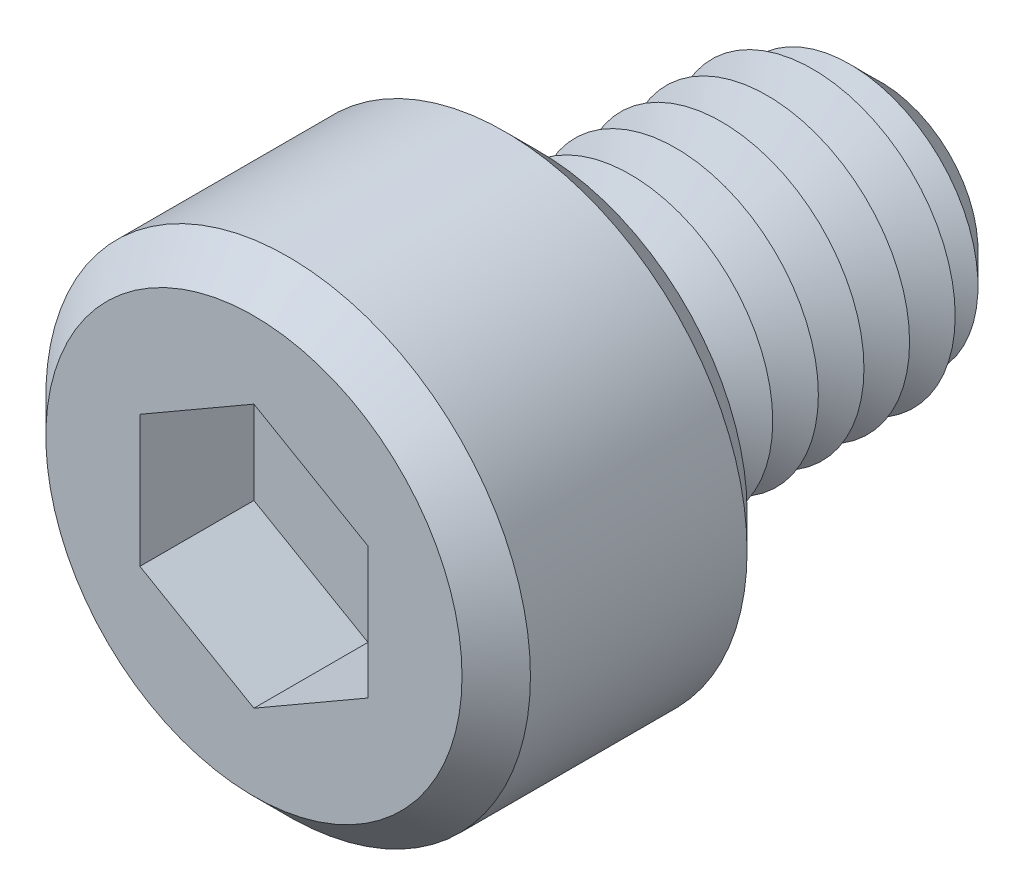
ISO-10303-21;
HEADER;
FILE_DESCRIPTION(('STEP AP214'),'2;1');
FILE_NAME('part.step','',(''),(''),'','','');
FILE_SCHEMA(('AUTOMOTIVE_DESIGN { 1 0 10303 214 1 1 1 1 }'));
ENDSEC;
DATA;
#1=APPLICATION_CONTEXT('core data for automotive mechanical design processes');
#2=APPLICATION_PROTOCOL_DEFINITION('international standard','automotive_design',2000,#1);
#3=PRODUCT_CONTEXT('',#1,'mechanical');
#4=PRODUCT('Part','Part','',(#3));
#5=PRODUCT_RELATED_PRODUCT_CATEGORY('part','',(#4));
#6=PRODUCT_DEFINITION_FORMATION('','',#4);
#7=PRODUCT_DEFINITION_CONTEXT('part definition',#1,'design');
#8=PRODUCT_DEFINITION('design','',#6,#7);
#9=PRODUCT_DEFINITION_SHAPE('','',#8);
#10=(LENGTH_UNIT() NAMED_UNIT(*) SI_UNIT(.MILLI.,.METRE.));
#11=(NAMED_UNIT(*) PLANE_ANGLE_UNIT() SI_UNIT($,.RADIAN.));
#12=(NAMED_UNIT(*) SI_UNIT($,.STERADIAN.) SOLID_ANGLE_UNIT());
#13=UNCERTAINTY_MEASURE_WITH_UNIT(LENGTH_MEASURE(1.E-05),#10,'distance_accuracy_value','');
#14=(GEOMETRIC_REPRESENTATION_CONTEXT(3) GLOBAL_UNCERTAINTY_ASSIGNED_CONTEXT((#13)) GLOBAL_UNIT_ASSIGNED_CONTEXT((#10,
#11,#12)) REPRESENTATION_CONTEXT('',''));
#15=CARTESIAN_POINT('',(0.,0.,0.));
#16=DIRECTION('',(0.,0.,1.));
#17=DIRECTION('',(1.,0.,0.));
#18=AXIS2_PLACEMENT_3D('',#15,#16,#17);
#19=CARTESIAN_POINT('',(0.,0.,5.));
#20=DIRECTION('',(0.,0.,-1.));
#21=DIRECTION('',(-1.,0.,0.));
#22=AXIS2_PLACEMENT_3D('',#19,#20,#21);
#23=CYLINDRICAL_SURFACE('',#22,4.25);
#24=CARTESIAN_POINT('',(0.,0.,0.600000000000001));
#25=DIRECTION('',(0.,0.,1.));
#26=DIRECTION('',(1.,0.,0.));
#27=AXIS2_PLACEMENT_3D('',#24,#25,#26);
#28=CIRCLE('',#27,4.25);
#29=CARTESIAN_POINT('',(4.25,0.,0.600000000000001));
#30=VERTEX_POINT('',#29);
#31=EDGE_CURVE('E232',#30,#30,#28,.T.);
#32=ORIENTED_EDGE('',*,*,#31,.T.);
#33=EDGE_LOOP('',(#32));
#34=FACE_BOUND('',#33,.T.);
#35=CARTESIAN_POINT('',(0.,0.,4.4));
#36=DIRECTION('',(0.,0.,1.));
#37=DIRECTION('',(1.,0.,0.));
#38=AXIS2_PLACEMENT_3D('',#35,#36,#37);
#39=CIRCLE('',#38,4.25);
#40=CARTESIAN_POINT('',(4.25,0.,4.4));
#41=VERTEX_POINT('',#40);
#42=EDGE_CURVE('E225',#41,#41,#39,.F.);
#43=ORIENTED_EDGE('',*,*,#42,.T.);
#44=EDGE_LOOP('',(#43));
#45=FACE_BOUND('',#44,.T.);
#46=ADVANCED_FACE('F39',(#34,#45),#23,.T.);
#47=CARTESIAN_POINT('',(0.,0.,5.));
#48=DIRECTION('',(0.,0.,1.));
#49=DIRECTION('',(1.,0.,0.));
#50=AXIS2_PLACEMENT_3D('',#47,#48,#49);
#51=PLANE('',#50);
#52=CARTESIAN_POINT('',(0.,0.,5.));
#53=DIRECTION('',(0.,0.,1.));
#54=DIRECTION('',(1.,0.,0.));
#55=AXIS2_PLACEMENT_3D('',#52,#53,#54);
#56=CIRCLE('',#55,3.65);
#57=CARTESIAN_POINT('',(3.65,0.,5.));
#58=VERTEX_POINT('',#57);
#59=EDGE_CURVE('E11',#58,#58,#56,.T.);
#60=ORIENTED_EDGE('',*,*,#59,.T.);
#61=EDGE_LOOP('',(#60));
#62=FACE_BOUND('',#61,.T.);
#63=DIRECTION('',(-0.866025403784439,0.5,0.));
#64=VECTOR('',#63,1.);
#65=CARTESIAN_POINT('',(2.,1.15470053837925,5.));
#66=LINE('',#65,#64);
#67=CARTESIAN_POINT('',(2.,1.15470053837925,5.));
#68=VERTEX_POINT('',#67);
#69=CARTESIAN_POINT('',(0.,2.3094010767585,5.));
#70=VERTEX_POINT('',#69);
#71=EDGE_CURVE('E55',#68,#70,#66,.T.);
#72=ORIENTED_EDGE('',*,*,#71,.F.);
#73=DIRECTION('',(0.,1.,0.));
#74=VECTOR('',#73,1.);
#75=CARTESIAN_POINT('',(2.,-1.15470053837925,5.));
#76=LINE('',#75,#74);
#77=CARTESIAN_POINT('',(2.,-1.15470053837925,5.));
#78=VERTEX_POINT('',#77);
#79=EDGE_CURVE('E150',#78,#68,#76,.T.);
#80=ORIENTED_EDGE('',*,*,#79,.F.);
#81=DIRECTION('',(0.866025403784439,0.5,0.));
#82=VECTOR('',#81,1.);
#83=CARTESIAN_POINT('',(0.,-2.3094010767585,5.));
#84=LINE('',#83,#82);
#85=CARTESIAN_POINT('',(0.,-2.3094010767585,5.));
#86=VERTEX_POINT('',#85);
#87=EDGE_CURVE('E147',#86,#78,#84,.T.);
#88=ORIENTED_EDGE('',*,*,#87,.F.);
#89=DIRECTION('',(0.866025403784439,-0.5,0.));
#90=VECTOR('',#89,1.);
#91=CARTESIAN_POINT('',(-2.,-1.15470053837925,5.));
#92=LINE('',#91,#90);
#93=CARTESIAN_POINT('',(-2.,-1.15470053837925,5.));
#94=VERTEX_POINT('',#93);
#95=EDGE_CURVE('E103',#94,#86,#92,.T.);
#96=ORIENTED_EDGE('',*,*,#95,.F.);
#97=DIRECTION('',(0.,-1.,0.));
#98=VECTOR('',#97,1.);
#99=CARTESIAN_POINT('',(-2.,1.15470053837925,5.));
#100=LINE('',#99,#98);
#101=CARTESIAN_POINT('',(-2.,1.15470053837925,5.));
#102=VERTEX_POINT('',#101);
#103=EDGE_CURVE('E141',#102,#94,#100,.T.);
#104=ORIENTED_EDGE('',*,*,#103,.F.);
#105=DIRECTION('',(-0.866025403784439,-0.5,0.));
#106=VECTOR('',#105,1.);
#107=CARTESIAN_POINT('',(0.,2.3094010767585,5.));
#108=LINE('',#107,#106);
#109=EDGE_CURVE('E136',#70,#102,#108,.T.);
#110=ORIENTED_EDGE('',*,*,#109,.F.);
#111=EDGE_LOOP('',(#72,#80,#88,#96,#104,#110));
#112=FACE_BOUND('',#111,.T.);
#113=ADVANCED_FACE('F250',(#62,#112),#51,.T.);
#114=CARTESIAN_POINT('',(0.,0.,0.));
#115=DIRECTION('',(0.,0.,1.));
#116=DIRECTION('',(1.,0.,0.));
#117=AXIS2_PLACEMENT_3D('',#114,#115,#116);
#118=PLANE('',#117);
#119=CARTESIAN_POINT('',(0.,0.,0.));
#120=DIRECTION('',(0.,0.,1.));
#121=DIRECTION('',(1.,0.,0.));
#122=AXIS2_PLACEMENT_3D('',#119,#120,#121);
#123=CIRCLE('',#122,3.65);
#124=CARTESIAN_POINT('',(3.65,0.,0.));
#125=VERTEX_POINT('',#124);
#126=EDGE_CURVE('E48',#125,#125,#123,.F.);
#127=ORIENTED_EDGE('',*,*,#126,.T.);
#128=EDGE_LOOP('',(#127));
#129=FACE_BOUND('',#128,.T.);
#130=CARTESIAN_POINT('',(0.,0.,0.));
#131=DIRECTION('',(0.,0.,1.));
#132=DIRECTION('',(1.,0.,0.));
#133=AXIS2_PLACEMENT_3D('',#130,#131,#132);
#134=CIRCLE('',#133,2.5);
#135=CARTESIAN_POINT('',(2.5,0.,0.));
#136=VERTEX_POINT('',#135);
#137=EDGE_CURVE('E217',#136,#136,#134,.T.);
#138=ORIENTED_EDGE('',*,*,#137,.T.);
#139=EDGE_LOOP('',(#138));
#140=FACE_BOUND('',#139,.T.);
#141=ADVANCED_FACE('F239',(#129,#140),#118,.F.);
#142=CARTESIAN_POINT('',(0.,0.,0.));
#143=DIRECTION('',(0.,0.,1.));
#144=DIRECTION('',(1.,0.,0.));
#145=AXIS2_PLACEMENT_3D('',#142,#143,#144);
#146=CONICAL_SURFACE('',#145,2.5,1.0471975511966);
#147=CARTESIAN_POINT('',(0.,0.,-0.400000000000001));
#148=DIRECTION('',(0.,0.,1.));
#149=DIRECTION('',(1.,0.,0.));
#150=AXIS2_PLACEMENT_3D('',#147,#148,#149);
#151=CIRCLE('',#150,1.80717967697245);
#152=CARTESIAN_POINT('',(1.80717967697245,0.,-0.400000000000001));
#153=VERTEX_POINT('',#152);
#154=EDGE_CURVE('E213',#153,#153,#151,.T.);
#155=ORIENTED_EDGE('',*,*,#154,.T.);
#156=EDGE_LOOP('',(#155));
#157=FACE_BOUND('',#156,.T.);
#158=ORIENTED_EDGE('',*,*,#137,.F.);
#159=EDGE_LOOP('',(#158));
#160=FACE_BOUND('',#159,.T.);
#161=ADVANCED_FACE('F356',(#157,#160),#146,.T.);
#162=CARTESIAN_POINT('',(0.,0.,-0.400000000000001));
#163=DIRECTION('',(0.,0.,-1.));
#164=DIRECTION('',(-1.,0.,0.));
#165=AXIS2_PLACEMENT_3D('',#162,#163,#164);
#166=CONICAL_SURFACE('',#165,1.80717967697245,1.0471975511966);
#167=CARTESIAN_POINT('',(0.,0.,-0.8));
#168=DIRECTION('',(0.,0.,1.));
#169=DIRECTION('',(1.,0.,0.));
#170=AXIS2_PLACEMENT_3D('',#167,#168,#169);
#171=CIRCLE('',#170,2.5);
#172=CARTESIAN_POINT('',(2.5,0.,-0.8));
#173=VERTEX_POINT('',#172);
#174=EDGE_CURVE('E209',#173,#173,#171,.T.);
#175=ORIENTED_EDGE('',*,*,#174,.T.);
#176=EDGE_LOOP('',(#175));
#177=FACE_BOUND('',#176,.T.);
#178=ORIENTED_EDGE('',*,*,#154,.F.);
#179=EDGE_LOOP('',(#178));
#180=FACE_BOUND('',#179,.T.);
#181=ADVANCED_FACE('F352',(#177,#180),#166,.T.);
#182=CARTESIAN_POINT('',(0.,0.,-0.8));
#183=DIRECTION('',(0.,0.,1.));
#184=DIRECTION('',(1.,0.,0.));
#185=AXIS2_PLACEMENT_3D('',#182,#183,#184);
#186=CONICAL_SURFACE('',#185,2.5,1.0471975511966);
#187=CARTESIAN_POINT('',(0.,0.,-1.2));
#188=DIRECTION('',(0.,0.,1.));
#189=DIRECTION('',(1.,0.,0.));
#190=AXIS2_PLACEMENT_3D('',#187,#188,#189);
#191=CIRCLE('',#190,1.80717967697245);
#192=CARTESIAN_POINT('',(1.80717967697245,0.,-1.2));
#193=VERTEX_POINT('',#192);
#194=EDGE_CURVE('E205',#193,#193,#191,.T.);
#195=ORIENTED_EDGE('',*,*,#194,.T.);
#196=EDGE_LOOP('',(#195));
#197=FACE_BOUND('',#196,.T.);
#198=ORIENTED_EDGE('',*,*,#174,.F.);
#199=EDGE_LOOP('',(#198));
#200=FACE_BOUND('',#199,.T.);
#201=ADVANCED_FACE('F348',(#197,#200),#186,.T.);
#202=CARTESIAN_POINT('',(0.,0.,-1.2));
#203=DIRECTION('',(0.,0.,-1.));
#204=DIRECTION('',(-1.,0.,0.));
#205=AXIS2_PLACEMENT_3D('',#202,#203,#204);
#206=CONICAL_SURFACE('',#205,1.80717967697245,1.0471975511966);
#207=CARTESIAN_POINT('',(0.,0.,-1.6));
#208=DIRECTION('',(0.,0.,1.));
#209=DIRECTION('',(1.,0.,0.));
#210=AXIS2_PLACEMENT_3D('',#207,#208,#209);
#211=CIRCLE('',#210,2.5);
#212=CARTESIAN_POINT('',(2.5,0.,-1.6));
#213=VERTEX_POINT('',#212);
#214=EDGE_CURVE('E202',#213,#213,#211,.T.);
#215=ORIENTED_EDGE('',*,*,#214,.T.);
#216=EDGE_LOOP('',(#215));
#217=FACE_BOUND('',#216,.T.);
#218=ORIENTED_EDGE('',*,*,#194,.F.);
#219=EDGE_LOOP('',(#218));
#220=FACE_BOUND('',#219,.T.);
#221=ADVANCED_FACE('F344',(#217,#220),#206,.T.);
#222=CARTESIAN_POINT('',(0.,0.,-1.6));
#223=DIRECTION('',(0.,0.,1.));
#224=DIRECTION('',(1.,0.,0.));
#225=AXIS2_PLACEMENT_3D('',#222,#223,#224);
#226=CONICAL_SURFACE('',#225,2.5,1.0471975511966);
#227=CARTESIAN_POINT('',(0.,0.,-2.));
#228=DIRECTION('',(0.,0.,1.));
#229=DIRECTION('',(1.,0.,0.));
#230=AXIS2_PLACEMENT_3D('',#227,#228,#229);
#231=CIRCLE('',#230,1.80717967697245);
#232=CARTESIAN_POINT('',(1.80717967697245,0.,-2.));
#233=VERTEX_POINT('',#232);
#234=EDGE_CURVE('E198',#233,#233,#231,.T.);
#235=ORIENTED_EDGE('',*,*,#234,.T.);
#236=EDGE_LOOP('',(#235));
#237=FACE_BOUND('',#236,.T.);
#238=ORIENTED_EDGE('',*,*,#214,.F.);
#239=EDGE_LOOP('',(#238));
#240=FACE_BOUND('',#239,.T.);
#241=ADVANCED_FACE('F340',(#237,#240),#226,.T.);
#242=CARTESIAN_POINT('',(0.,0.,-2.));
#243=DIRECTION('',(0.,0.,-1.));
#244=DIRECTION('',(-1.,0.,0.));
#245=AXIS2_PLACEMENT_3D('',#242,#243,#244);
#246=CONICAL_SURFACE('',#245,1.80717967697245,1.0471975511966);
#247=CARTESIAN_POINT('',(0.,0.,-2.4));
#248=DIRECTION('',(0.,0.,1.));
#249=DIRECTION('',(1.,0.,0.));
#250=AXIS2_PLACEMENT_3D('',#247,#248,#249);
#251=CIRCLE('',#250,2.5);
#252=CARTESIAN_POINT('',(2.5,0.,-2.4));
#253=VERTEX_POINT('',#252);
#254=EDGE_CURVE('E194',#253,#253,#251,.T.);
#255=ORIENTED_EDGE('',*,*,#254,.T.);
#256=EDGE_LOOP('',(#255));
#257=FACE_BOUND('',#256,.T.);
#258=ORIENTED_EDGE('',*,*,#234,.F.);
#259=EDGE_LOOP('',(#258));
#260=FACE_BOUND('',#259,.T.);
#261=ADVANCED_FACE('F336',(#257,#260),#246,.T.);
#262=CARTESIAN_POINT('',(0.,0.,-2.4));
#263=DIRECTION('',(0.,0.,1.));
#264=DIRECTION('',(1.,0.,0.));
#265=AXIS2_PLACEMENT_3D('',#262,#263,#264);
#266=CONICAL_SURFACE('',#265,2.5,1.0471975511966);
#267=CARTESIAN_POINT('',(0.,0.,-2.8));
#268=DIRECTION('',(0.,0.,1.));
#269=DIRECTION('',(1.,0.,0.));
#270=AXIS2_PLACEMENT_3D('',#267,#268,#269);
#271=CIRCLE('',#270,1.80717967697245);
#272=CARTESIAN_POINT('',(1.80717967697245,0.,-2.8));
#273=VERTEX_POINT('',#272);
#274=EDGE_CURVE('E190',#273,#273,#271,.T.);
#275=ORIENTED_EDGE('',*,*,#274,.T.);
#276=EDGE_LOOP('',(#275));
#277=FACE_BOUND('',#276,.T.);
#278=ORIENTED_EDGE('',*,*,#254,.F.);
#279=EDGE_LOOP('',(#278));
#280=FACE_BOUND('',#279,.T.);
#281=ADVANCED_FACE('F332',(#277,#280),#266,.T.);
#282=CARTESIAN_POINT('',(0.,0.,-2.8));
#283=DIRECTION('',(0.,0.,-1.));
#284=DIRECTION('',(-1.,0.,0.));
#285=AXIS2_PLACEMENT_3D('',#282,#283,#284);
#286=CONICAL_SURFACE('',#285,1.80717967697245,1.0471975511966);
#287=CARTESIAN_POINT('',(0.,0.,-3.2));
#288=DIRECTION('',(0.,0.,1.));
#289=DIRECTION('',(1.,0.,0.));
#290=AXIS2_PLACEMENT_3D('',#287,#288,#289);
#291=CIRCLE('',#290,2.5);
#292=CARTESIAN_POINT('',(2.5,0.,-3.2));
#293=VERTEX_POINT('',#292);
#294=EDGE_CURVE('E186',#293,#293,#291,.T.);
#295=ORIENTED_EDGE('',*,*,#294,.T.);
#296=EDGE_LOOP('',(#295));
#297=FACE_BOUND('',#296,.T.);
#298=ORIENTED_EDGE('',*,*,#274,.F.);
#299=EDGE_LOOP('',(#298));
#300=FACE_BOUND('',#299,.T.);
#301=ADVANCED_FACE('F328',(#297,#300),#286,.T.);
#302=CARTESIAN_POINT('',(0.,0.,-3.2));
#303=DIRECTION('',(0.,0.,1.));
#304=DIRECTION('',(1.,0.,0.));
#305=AXIS2_PLACEMENT_3D('',#302,#303,#304);
#306=CONICAL_SURFACE('',#305,2.5,1.0471975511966);
#307=CARTESIAN_POINT('',(0.,0.,-3.6));
#308=DIRECTION('',(0.,0.,1.));
#309=DIRECTION('',(1.,0.,0.));
#310=AXIS2_PLACEMENT_3D('',#307,#308,#309);
#311=CIRCLE('',#310,1.80717967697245);
#312=CARTESIAN_POINT('',(1.80717967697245,0.,-3.6));
#313=VERTEX_POINT('',#312);
#314=EDGE_CURVE('E182',#313,#313,#311,.T.);
#315=ORIENTED_EDGE('',*,*,#314,.T.);
#316=EDGE_LOOP('',(#315));
#317=FACE_BOUND('',#316,.T.);
#318=ORIENTED_EDGE('',*,*,#294,.F.);
#319=EDGE_LOOP('',(#318));
#320=FACE_BOUND('',#319,.T.);
#321=ADVANCED_FACE('F324',(#317,#320),#306,.T.);
#322=CARTESIAN_POINT('',(0.,0.,-3.6));
#323=DIRECTION('',(0.,0.,-1.));
#324=DIRECTION('',(-1.,0.,0.));
#325=AXIS2_PLACEMENT_3D('',#322,#323,#324);
#326=CONICAL_SURFACE('',#325,1.80717967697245,1.0471975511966);
#327=CARTESIAN_POINT('',(0.,0.,-4.));
#328=DIRECTION('',(0.,0.,1.));
#329=DIRECTION('',(1.,0.,0.));
#330=AXIS2_PLACEMENT_3D('',#327,#328,#329);
#331=CIRCLE('',#330,2.5);
#332=CARTESIAN_POINT('',(2.5,0.,-4.));
#333=VERTEX_POINT('',#332);
#334=EDGE_CURVE('E178',#333,#333,#331,.T.);
#335=ORIENTED_EDGE('',*,*,#334,.T.);
#336=EDGE_LOOP('',(#335));
#337=FACE_BOUND('',#336,.T.);
#338=ORIENTED_EDGE('',*,*,#314,.F.);
#339=EDGE_LOOP('',(#338));
#340=FACE_BOUND('',#339,.T.);
#341=ADVANCED_FACE('F320',(#337,#340),#326,.T.);
#342=CARTESIAN_POINT('',(0.,0.,-4.));
#343=DIRECTION('',(0.,0.,1.));
#344=DIRECTION('',(1.,0.,0.));
#345=AXIS2_PLACEMENT_3D('',#342,#343,#344);
#346=CONICAL_SURFACE('',#345,2.5,1.0471975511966);
#347=CARTESIAN_POINT('',(0.,0.,-4.4));
#348=DIRECTION('',(0.,0.,1.));
#349=DIRECTION('',(1.,0.,0.));
#350=AXIS2_PLACEMENT_3D('',#347,#348,#349);
#351=CIRCLE('',#350,1.80717967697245);
#352=CARTESIAN_POINT('',(1.80717967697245,0.,-4.4));
#353=VERTEX_POINT('',#352);
#354=EDGE_CURVE('E174',#353,#353,#351,.T.);
#355=ORIENTED_EDGE('',*,*,#354,.T.);
#356=EDGE_LOOP('',(#355));
#357=FACE_BOUND('',#356,.T.);
#358=ORIENTED_EDGE('',*,*,#334,.F.);
#359=EDGE_LOOP('',(#358));
#360=FACE_BOUND('',#359,.T.);
#361=ADVANCED_FACE('F316',(#357,#360),#346,.T.);
#362=CARTESIAN_POINT('',(0.,0.,-4.4));
#363=DIRECTION('',(0.,0.,-1.));
#364=DIRECTION('',(-1.,0.,0.));
#365=AXIS2_PLACEMENT_3D('',#362,#363,#364);
#366=CONICAL_SURFACE('',#365,1.80717967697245,1.0471975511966);
#367=CARTESIAN_POINT('',(0.,0.,-4.8));
#368=DIRECTION('',(0.,0.,1.));
#369=DIRECTION('',(1.,0.,0.));
#370=AXIS2_PLACEMENT_3D('',#367,#368,#369);
#371=CIRCLE('',#370,2.5);
#372=CARTESIAN_POINT('',(2.5,0.,-4.8));
#373=VERTEX_POINT('',#372);
#374=EDGE_CURVE('E169',#373,#373,#371,.T.);
#375=ORIENTED_EDGE('',*,*,#374,.T.);
#376=EDGE_LOOP('',(#375));
#377=FACE_BOUND('',#376,.T.);
#378=ORIENTED_EDGE('',*,*,#354,.F.);
#379=EDGE_LOOP('',(#378));
#380=FACE_BOUND('',#379,.T.);
#381=ADVANCED_FACE('F312',(#377,#380),#366,.T.);
#382=CARTESIAN_POINT('',(0.,0.,-4.8));
#383=DIRECTION('',(0.,0.,1.));
#384=DIRECTION('',(1.,0.,0.));
#385=AXIS2_PLACEMENT_3D('',#382,#383,#384);
#386=CONICAL_SURFACE('',#385,2.5,1.0471975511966);
#387=CARTESIAN_POINT('',(0.,0.,-5.2));
#388=DIRECTION('',(0.,0.,1.));
#389=DIRECTION('',(1.,0.,0.));
#390=AXIS2_PLACEMENT_3D('',#387,#388,#389);
#391=CIRCLE('',#390,1.80717967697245);
#392=CARTESIAN_POINT('',(1.80717967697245,0.,-5.2));
#393=VERTEX_POINT('',#392);
#394=EDGE_CURVE('E156',#393,#393,#391,.T.);
#395=ORIENTED_EDGE('',*,*,#394,.T.);
#396=EDGE_LOOP('',(#395));
#397=FACE_BOUND('',#396,.T.);
#398=ORIENTED_EDGE('',*,*,#374,.F.);
#399=EDGE_LOOP('',(#398));
#400=FACE_BOUND('',#399,.T.);
#401=ADVANCED_FACE('F308',(#397,#400),#386,.T.);
#402=CARTESIAN_POINT('',(0.,0.,-5.2));
#403=DIRECTION('',(0.,0.,-1.));
#404=DIRECTION('',(-1.,0.,0.));
#405=AXIS2_PLACEMENT_3D('',#402,#403,#404);
#406=CONICAL_SURFACE('',#405,1.80717967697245,1.0471975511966);
#407=CARTESIAN_POINT('',(0.,0.,-5.45358983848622));
#408=DIRECTION('',(0.,0.,-1.));
#409=DIRECTION('',(-1.,0.,0.));
#410=AXIS2_PLACEMENT_3D('',#407,#408,#409);
#411=CIRCLE('',#410,2.24641016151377);
#412=CARTESIAN_POINT('',(-2.24641016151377,0.,-5.45358983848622));
#413=VERTEX_POINT('',#412);
#414=EDGE_CURVE('E173',#413,#413,#411,.T.);
#415=ORIENTED_EDGE('',*,*,#414,.F.);
#416=EDGE_LOOP('',(#415));
#417=FACE_BOUND('',#416,.T.);
#418=ORIENTED_EDGE('',*,*,#394,.F.);
#419=EDGE_LOOP('',(#418));
#420=FACE_BOUND('',#419,.T.);
#421=ADVANCED_FACE('F304',(#417,#420),#406,.T.);
#422=CARTESIAN_POINT('',(0.,0.,-6.));
#423=DIRECTION('',(0.,0.,-1.));
#424=DIRECTION('',(-1.,0.,0.));
#425=AXIS2_PLACEMENT_3D('',#422,#423,#424);
#426=PLANE('',#425);
#427=CARTESIAN_POINT('',(0.,0.,-6.));
#428=DIRECTION('',(0.,0.,-1.));
#429=DIRECTION('',(-1.,0.,0.));
#430=AXIS2_PLACEMENT_3D('',#427,#428,#429);
#431=CIRCLE('',#430,0.65);
#432=CARTESIAN_POINT('',(-0.65,0.,-6.));
#433=VERTEX_POINT('',#432);
#434=EDGE_CURVE('E137',#433,#433,#431,.F.);
#435=ORIENTED_EDGE('',*,*,#434,.T.);
#436=EDGE_LOOP('',(#435));
#437=FACE_BOUND('',#436,.T.);
#438=CARTESIAN_POINT('',(0.,0.,-6.));
#439=DIRECTION('',(0.,0.,-1.));
#440=DIRECTION('',(-1.,0.,0.));
#441=AXIS2_PLACEMENT_3D('',#438,#439,#440);
#442=CIRCLE('',#441,1.7);
#443=CARTESIAN_POINT('',(-1.7,0.,-6.));
#444=VERTEX_POINT('',#443);
#445=EDGE_CURVE('E221',#444,#444,#442,.T.);
#446=ORIENTED_EDGE('',*,*,#445,.T.);
#447=EDGE_LOOP('',(#446));
#448=FACE_BOUND('',#447,.T.);
#449=ADVANCED_FACE('F307',(#437,#448),#426,.T.);
#450=CARTESIAN_POINT('',(0.,0.,-6.));
#451=DIRECTION('',(0.,0.,1.));
#452=DIRECTION('',(1.,0.,0.));
#453=AXIS2_PLACEMENT_3D('',#450,#451,#452);
#454=CONICAL_SURFACE('',#453,1.7,0.785398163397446);
#455=ORIENTED_EDGE('',*,*,#445,.F.);
#456=EDGE_LOOP('',(#455));
#457=FACE_BOUND('',#456,.T.);
#458=ORIENTED_EDGE('',*,*,#414,.T.);
#459=EDGE_LOOP('',(#458));
#460=FACE_BOUND('',#459,.T.);
#461=ADVANCED_FACE('F303',(#457,#460),#454,.T.);
#462=CARTESIAN_POINT('',(2.,1.15470053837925,3.));
#463=DIRECTION('',(0.5,0.866025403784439,0.));
#464=DIRECTION('',(-0.866025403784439,0.5,0.));
#465=AXIS2_PLACEMENT_3D('',#462,#463,#464);
#466=PLANE('',#465);
#467=ORIENTED_EDGE('',*,*,#71,.T.);
#468=DIRECTION('',(0.,0.,1.));
#469=VECTOR('',#468,1.);
#470=CARTESIAN_POINT('',(0.,2.3094010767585,3.));
#471=LINE('',#470,#469);
#472=CARTESIAN_POINT('',(0.,2.3094010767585,3.));
#473=VERTEX_POINT('',#472);
#474=EDGE_CURVE('E85',#473,#70,#471,.T.);
#475=ORIENTED_EDGE('',*,*,#474,.F.);
#476=DIRECTION('',(-0.866025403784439,0.5,0.));
#477=VECTOR('',#476,1.);
#478=CARTESIAN_POINT('',(2.,1.15470053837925,3.));
#479=LINE('',#478,#477);
#480=CARTESIAN_POINT('',(2.,1.15470053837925,3.));
#481=VERTEX_POINT('',#480);
#482=EDGE_CURVE('E153',#481,#473,#479,.T.);
#483=ORIENTED_EDGE('',*,*,#482,.F.);
#484=DIRECTION('',(0.,0.,1.));
#485=VECTOR('',#484,1.);
#486=CARTESIAN_POINT('',(2.,1.15470053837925,3.));
#487=LINE('',#486,#485);
#488=EDGE_CURVE('E63',#481,#68,#487,.T.);
#489=ORIENTED_EDGE('',*,*,#488,.T.);
#490=EDGE_LOOP('',(#467,#475,#483,#489));
#491=FACE_BOUND('',#490,.T.);
#492=ADVANCED_FACE('F293',(#491),#466,.F.);
#493=CARTESIAN_POINT('',(2.,-1.15470053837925,3.));
#494=DIRECTION('',(1.,0.,0.));
#495=DIRECTION('',(0.,0.,-1.));
#496=AXIS2_PLACEMENT_3D('',#493,#494,#495);
#497=PLANE('',#496);
#498=ORIENTED_EDGE('',*,*,#79,.T.);
#499=ORIENTED_EDGE('',*,*,#488,.F.);
#500=DIRECTION('',(0.,1.,0.));
#501=VECTOR('',#500,1.);
#502=CARTESIAN_POINT('',(2.,-1.15470053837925,3.));
#503=LINE('',#502,#501);
#504=CARTESIAN_POINT('',(2.,-1.15470053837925,3.));
#505=VERTEX_POINT('',#504);
#506=EDGE_CURVE('E117',#505,#481,#503,.T.);
#507=ORIENTED_EDGE('',*,*,#506,.F.);
#508=DIRECTION('',(0.,0.,1.));
#509=VECTOR('',#508,1.);
#510=CARTESIAN_POINT('',(2.,-1.15470053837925,3.));
#511=LINE('',#510,#509);
#512=EDGE_CURVE('E108',#505,#78,#511,.T.);
#513=ORIENTED_EDGE('',*,*,#512,.T.);
#514=EDGE_LOOP('',(#498,#499,#507,#513));
#515=FACE_BOUND('',#514,.T.);
#516=ADVANCED_FACE('F290',(#515),#497,.F.);
#517=CARTESIAN_POINT('',(0.,-2.3094010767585,3.));
#518=DIRECTION('',(0.5,-0.866025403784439,0.));
#519=DIRECTION('',(0.866025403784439,0.5,0.));
#520=AXIS2_PLACEMENT_3D('',#517,#518,#519);
#521=PLANE('',#520);
#522=ORIENTED_EDGE('',*,*,#87,.T.);
#523=ORIENTED_EDGE('',*,*,#512,.F.);
#524=DIRECTION('',(0.866025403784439,0.5,0.));
#525=VECTOR('',#524,1.);
#526=CARTESIAN_POINT('',(0.,-2.3094010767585,3.));
#527=LINE('',#526,#525);
#528=CARTESIAN_POINT('',(0.,-2.3094010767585,3.));
#529=VERTEX_POINT('',#528);
#530=EDGE_CURVE('E112',#529,#505,#527,.T.);
#531=ORIENTED_EDGE('',*,*,#530,.F.);
#532=DIRECTION('',(0.,0.,1.));
#533=VECTOR('',#532,1.);
#534=CARTESIAN_POINT('',(0.,-2.3094010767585,3.));
#535=LINE('',#534,#533);
#536=EDGE_CURVE('E96',#529,#86,#535,.T.);
#537=ORIENTED_EDGE('',*,*,#536,.T.);
#538=EDGE_LOOP('',(#522,#523,#531,#537));
#539=FACE_BOUND('',#538,.T.);
#540=ADVANCED_FACE('F113',(#539),#521,.F.);
#541=CARTESIAN_POINT('',(-2.,-1.15470053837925,3.));
#542=DIRECTION('',(-0.5,-0.866025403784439,0.));
#543=DIRECTION('',(0.866025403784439,-0.5,0.));
#544=AXIS2_PLACEMENT_3D('',#541,#542,#543);
#545=PLANE('',#544);
#546=ORIENTED_EDGE('',*,*,#95,.T.);
#547=ORIENTED_EDGE('',*,*,#536,.F.);
#548=DIRECTION('',(0.866025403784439,-0.5,0.));
#549=VECTOR('',#548,1.);
#550=CARTESIAN_POINT('',(-2.,-1.15470053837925,3.));
#551=LINE('',#550,#549);
#552=CARTESIAN_POINT('',(-2.,-1.15470053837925,3.));
#553=VERTEX_POINT('',#552);
#554=EDGE_CURVE('E100',#553,#529,#551,.T.);
#555=ORIENTED_EDGE('',*,*,#554,.F.);
#556=DIRECTION('',(0.,0.,1.));
#557=VECTOR('',#556,1.);
#558=CARTESIAN_POINT('',(-2.,-1.15470053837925,3.));
#559=LINE('',#558,#557);
#560=EDGE_CURVE('E109',#553,#94,#559,.T.);
#561=ORIENTED_EDGE('',*,*,#560,.T.);
#562=EDGE_LOOP('',(#546,#547,#555,#561));
#563=FACE_BOUND('',#562,.T.);
#564=ADVANCED_FACE('F98',(#563),#545,.F.);
#565=CARTESIAN_POINT('',(-2.,1.15470053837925,3.));
#566=DIRECTION('',(-1.,0.,0.));
#567=DIRECTION('',(0.,0.,1.));
#568=AXIS2_PLACEMENT_3D('',#565,#566,#567);
#569=PLANE('',#568);
#570=ORIENTED_EDGE('',*,*,#103,.T.);
#571=ORIENTED_EDGE('',*,*,#560,.F.);
#572=DIRECTION('',(0.,-1.,0.));
#573=VECTOR('',#572,1.);
#574=CARTESIAN_POINT('',(-2.,1.15470053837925,3.));
#575=LINE('',#574,#573);
#576=CARTESIAN_POINT('',(-2.,1.15470053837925,3.));
#577=VERTEX_POINT('',#576);
#578=EDGE_CURVE('E123',#577,#553,#575,.T.);
#579=ORIENTED_EDGE('',*,*,#578,.F.);
#580=DIRECTION('',(0.,0.,1.));
#581=VECTOR('',#580,1.);
#582=CARTESIAN_POINT('',(-2.,1.15470053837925,3.));
#583=LINE('',#582,#581);
#584=EDGE_CURVE('E161',#577,#102,#583,.T.);
#585=ORIENTED_EDGE('',*,*,#584,.T.);
#586=EDGE_LOOP('',(#570,#571,#579,#585));
#587=FACE_BOUND('',#586,.T.);
#588=ADVANCED_FACE('F287',(#587),#569,.F.);
#589=CARTESIAN_POINT('',(0.,2.3094010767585,3.));
#590=DIRECTION('',(-0.5,0.866025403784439,0.));
#591=DIRECTION('',(-0.866025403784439,-0.5,0.));
#592=AXIS2_PLACEMENT_3D('',#589,#590,#591);
#593=PLANE('',#592);
#594=ORIENTED_EDGE('',*,*,#109,.T.);
#595=ORIENTED_EDGE('',*,*,#584,.F.);
#596=DIRECTION('',(-0.866025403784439,-0.5,0.));
#597=VECTOR('',#596,1.);
#598=CARTESIAN_POINT('',(0.,2.3094010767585,3.));
#599=LINE('',#598,#597);
#600=EDGE_CURVE('E128',#473,#577,#599,.T.);
#601=ORIENTED_EDGE('',*,*,#600,.F.);
#602=ORIENTED_EDGE('',*,*,#474,.T.);
#603=EDGE_LOOP('',(#594,#595,#601,#602));
#604=FACE_BOUND('',#603,.T.);
#605=ADVANCED_FACE('F265',(#604),#593,.F.);
#606=CARTESIAN_POINT('',(0.,0.,3.));
#607=DIRECTION('',(0.,0.,1.));
#608=DIRECTION('',(1.,0.,0.));
#609=AXIS2_PLACEMENT_3D('',#606,#607,#608);
#610=PLANE('',#609);
#611=CARTESIAN_POINT('',(0.,0.,3.));
#612=DIRECTION('',(0.,0.,1.));
#613=DIRECTION('',(1.,0.,0.));
#614=AXIS2_PLACEMENT_3D('',#611,#612,#613);
#615=CIRCLE('',#614,0.65);
#616=CARTESIAN_POINT('',(0.65,0.,3.));
#617=VERTEX_POINT('',#616);
#618=EDGE_CURVE('E273',#617,#617,#615,.T.);
#619=ORIENTED_EDGE('',*,*,#618,.F.);
#620=EDGE_LOOP('',(#619));
#621=FACE_BOUND('',#620,.T.);
#622=ORIENTED_EDGE('',*,*,#482,.T.);
#623=ORIENTED_EDGE('',*,*,#600,.T.);
#624=ORIENTED_EDGE('',*,*,#578,.T.);
#625=ORIENTED_EDGE('',*,*,#554,.T.);
#626=ORIENTED_EDGE('',*,*,#530,.T.);
#627=ORIENTED_EDGE('',*,*,#506,.T.);
#628=EDGE_LOOP('',(#622,#623,#624,#625,#626,#627));
#629=FACE_BOUND('',#628,.T.);
#630=ADVANCED_FACE('F120',(#621,#629),#610,.T.);
#631=CARTESIAN_POINT('',(0.,0.,-7.83847763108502));
#632=DIRECTION('',(0.,0.,1.));
#633=DIRECTION('',(1.,0.,0.));
#634=AXIS2_PLACEMENT_3D('',#631,#632,#633);
#635=CYLINDRICAL_SURFACE('',#634,0.65);
#636=ORIENTED_EDGE('',*,*,#618,.T.);
#637=EDGE_LOOP('',(#636));
#638=FACE_BOUND('',#637,.T.);
#639=ORIENTED_EDGE('',*,*,#434,.F.);
#640=EDGE_LOOP('',(#639));
#641=FACE_BOUND('',#640,.T.);
#642=ADVANCED_FACE('F245',(#638,#641),#635,.F.);
#643=CARTESIAN_POINT('',(0.,0.,0.600000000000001));
#644=DIRECTION('',(0.,0.,1.));
#645=DIRECTION('',(1.,0.,0.));
#646=AXIS2_PLACEMENT_3D('',#643,#644,#645);
#647=CONICAL_SURFACE('',#646,4.25,0.785398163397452);
#648=ORIENTED_EDGE('',*,*,#126,.F.);
#649=EDGE_LOOP('',(#648));
#650=FACE_BOUND('',#649,.T.);
#651=ORIENTED_EDGE('',*,*,#31,.F.);
#652=EDGE_LOOP('',(#651));
#653=FACE_BOUND('',#652,.T.);
#654=ADVANCED_FACE('F242',(#650,#653),#647,.T.);
#655=CARTESIAN_POINT('',(0.,0.,5.));
#656=DIRECTION('',(0.,0.,-1.));
#657=DIRECTION('',(-1.,0.,0.));
#658=AXIS2_PLACEMENT_3D('',#655,#656,#657);
#659=CONICAL_SURFACE('',#658,3.65,0.785398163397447);
#660=ORIENTED_EDGE('',*,*,#42,.F.);
#661=EDGE_LOOP('',(#660));
#662=FACE_BOUND('',#661,.T.);
#663=ORIENTED_EDGE('',*,*,#59,.F.);
#664=EDGE_LOOP('',(#663));
#665=FACE_BOUND('',#664,.T.);
#666=ADVANCED_FACE('F41',(#662,#665),#659,.T.);
#667=CLOSED_SHELL('',(#46,#113,#141,#161,#181,#201,#221,#241,#261,#281,#301,#321,#341,#361,#381,
#401,#421,#449,#461,#492,#516,#540,#564,#588,#605,#630,#642,#654,#666));
#668=MANIFOLD_SOLID_BREP('B2',#667);
#669=ADVANCED_BREP_SHAPE_REPRESENTATION('',(#18,#668),#14);
#670=SHAPE_DEFINITION_REPRESENTATION(#9,#669);
ENDSEC;
END-ISO-10303-21;
